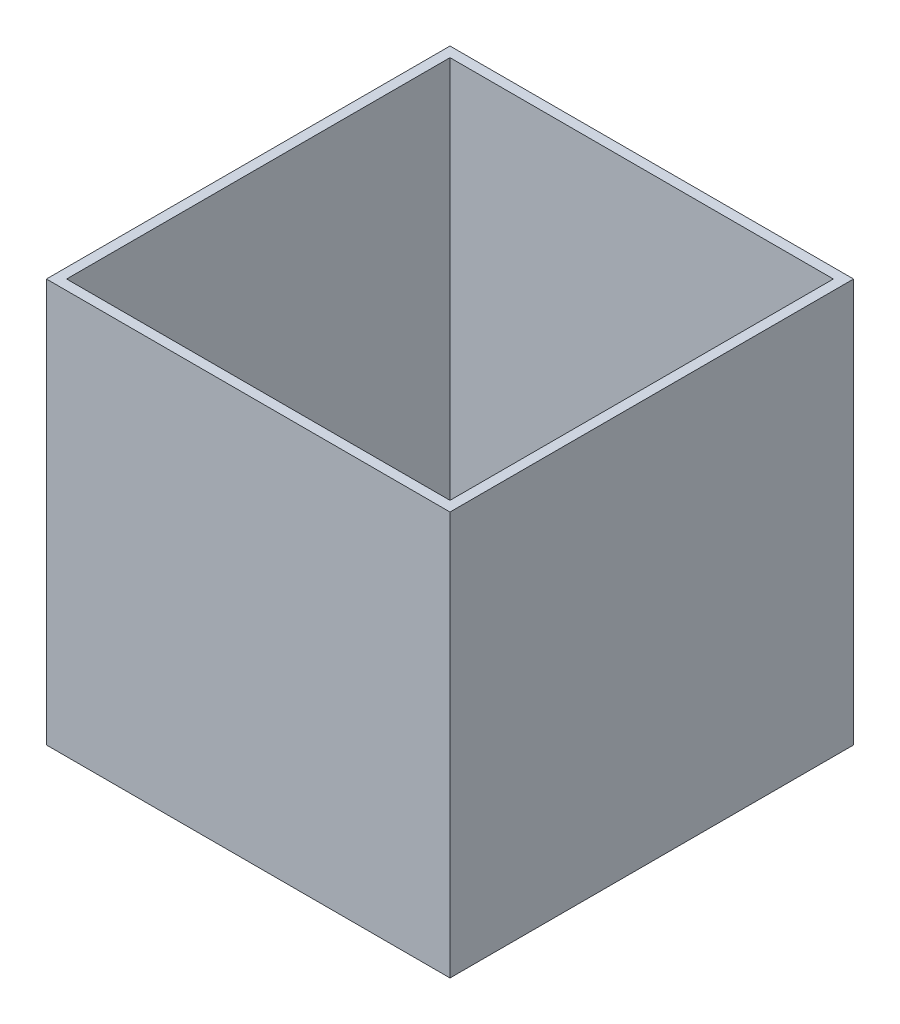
ISO-10303-21;
HEADER;
FILE_DESCRIPTION(('STEP AP214'),'2;1');
FILE_NAME('part.step','',(''),(''),'','','');
FILE_SCHEMA(('AUTOMOTIVE_DESIGN { 1 0 10303 214 1 1 1 1 }'));
ENDSEC;
DATA;
#1=APPLICATION_CONTEXT('core data for automotive mechanical design processes');
#2=APPLICATION_PROTOCOL_DEFINITION('international standard','automotive_design',2000,#1);
#3=PRODUCT_CONTEXT('',#1,'mechanical');
#4=PRODUCT('Part','Part','',(#3));
#5=PRODUCT_RELATED_PRODUCT_CATEGORY('part','',(#4));
#6=PRODUCT_DEFINITION_FORMATION('','',#4);
#7=PRODUCT_DEFINITION_CONTEXT('part definition',#1,'design');
#8=PRODUCT_DEFINITION('design','',#6,#7);
#9=PRODUCT_DEFINITION_SHAPE('','',#8);
#10=(LENGTH_UNIT() NAMED_UNIT(*) SI_UNIT(.MILLI.,.METRE.));
#11=(NAMED_UNIT(*) PLANE_ANGLE_UNIT() SI_UNIT($,.RADIAN.));
#12=(NAMED_UNIT(*) SI_UNIT($,.STERADIAN.) SOLID_ANGLE_UNIT());
#13=UNCERTAINTY_MEASURE_WITH_UNIT(LENGTH_MEASURE(1.E-05),#10,'distance_accuracy_value','');
#14=(GEOMETRIC_REPRESENTATION_CONTEXT(3) GLOBAL_UNCERTAINTY_ASSIGNED_CONTEXT((#13)) GLOBAL_UNIT_ASSIGNED_CONTEXT((#10,
#11,#12)) REPRESENTATION_CONTEXT('',''));
#15=CARTESIAN_POINT('',(0.,0.,0.));
#16=DIRECTION('',(0.,0.,1.));
#17=DIRECTION('',(1.,0.,0.));
#18=AXIS2_PLACEMENT_3D('',#15,#16,#17);
#19=CARTESIAN_POINT('',(0.,101.6,0.));
#20=DIRECTION('',(0.,0.,-1.));
#21=DIRECTION('',(-1.,0.,0.));
#22=AXIS2_PLACEMENT_3D('',#19,#20,#21);
#23=PLANE('',#22);
#24=DIRECTION('',(1.,0.,0.));
#25=VECTOR('',#24,1.);
#26=CARTESIAN_POINT('',(0.,0.,0.));
#27=LINE('',#26,#25);
#28=CARTESIAN_POINT('',(0.,0.,0.));
#29=VERTEX_POINT('',#28);
#30=CARTESIAN_POINT('',(101.6,0.,0.));
#31=VERTEX_POINT('',#30);
#32=EDGE_CURVE('E150',#29,#31,#27,.T.);
#33=ORIENTED_EDGE('',*,*,#32,.T.);
#34=DIRECTION('',(0.,-1.,0.));
#35=VECTOR('',#34,1.);
#36=CARTESIAN_POINT('',(101.6,101.6,0.));
#37=LINE('',#36,#35);
#38=CARTESIAN_POINT('',(101.6,101.6,0.));
#39=VERTEX_POINT('',#38);
#40=EDGE_CURVE('E11',#39,#31,#37,.T.);
#41=ORIENTED_EDGE('',*,*,#40,.F.);
#42=DIRECTION('',(1.,0.,0.));
#43=VECTOR('',#42,1.);
#44=CARTESIAN_POINT('',(0.,101.6,0.));
#45=LINE('',#44,#43);
#46=CARTESIAN_POINT('',(0.,101.6,0.));
#47=VERTEX_POINT('',#46);
#48=EDGE_CURVE('E141',#47,#39,#45,.T.);
#49=ORIENTED_EDGE('',*,*,#48,.F.);
#50=DIRECTION('',(0.,-1.,0.));
#51=VECTOR('',#50,1.);
#52=CARTESIAN_POINT('',(0.,101.6,0.));
#53=LINE('',#52,#51);
#54=EDGE_CURVE('E56',#47,#29,#53,.T.);
#55=ORIENTED_EDGE('',*,*,#54,.T.);
#56=EDGE_LOOP('',(#33,#41,#49,#55));
#57=FACE_BOUND('',#56,.T.);
#58=ADVANCED_FACE('F33',(#57),#23,.F.);
#59=CARTESIAN_POINT('',(101.6,101.6,0.));
#60=DIRECTION('',(-1.,0.,0.));
#61=DIRECTION('',(0.,0.,1.));
#62=AXIS2_PLACEMENT_3D('',#59,#60,#61);
#63=PLANE('',#62);
#64=DIRECTION('',(0.,0.,-1.));
#65=VECTOR('',#64,1.);
#66=CARTESIAN_POINT('',(101.6,0.,0.));
#67=LINE('',#66,#65);
#68=CARTESIAN_POINT('',(101.6,0.,-101.6));
#69=VERTEX_POINT('',#68);
#70=EDGE_CURVE('E152',#31,#69,#67,.T.);
#71=ORIENTED_EDGE('',*,*,#70,.T.);
#72=DIRECTION('',(0.,-1.,0.));
#73=VECTOR('',#72,1.);
#74=CARTESIAN_POINT('',(101.6,101.6,-101.6));
#75=LINE('',#74,#73);
#76=CARTESIAN_POINT('',(101.6,101.6,-101.6));
#77=VERTEX_POINT('',#76);
#78=EDGE_CURVE('E40',#77,#69,#75,.T.);
#79=ORIENTED_EDGE('',*,*,#78,.F.);
#80=DIRECTION('',(0.,0.,-1.));
#81=VECTOR('',#80,1.);
#82=CARTESIAN_POINT('',(101.6,101.6,0.));
#83=LINE('',#82,#81);
#84=EDGE_CURVE('E82',#39,#77,#83,.T.);
#85=ORIENTED_EDGE('',*,*,#84,.F.);
#86=ORIENTED_EDGE('',*,*,#40,.T.);
#87=EDGE_LOOP('',(#71,#79,#85,#86));
#88=FACE_BOUND('',#87,.T.);
#89=ADVANCED_FACE('F166',(#88),#63,.F.);
#90=CARTESIAN_POINT('',(0.,101.6,-101.6));
#91=DIRECTION('',(0.,0.,-1.));
#92=DIRECTION('',(-1.,0.,0.));
#93=AXIS2_PLACEMENT_3D('',#90,#91,#92);
#94=PLANE('',#93);
#95=DIRECTION('',(1.,0.,0.));
#96=VECTOR('',#95,1.);
#97=CARTESIAN_POINT('',(0.,0.,-101.6));
#98=LINE('',#97,#96);
#99=CARTESIAN_POINT('',(0.,0.,-101.6));
#100=VERTEX_POINT('',#99);
#101=EDGE_CURVE('E155',#100,#69,#98,.T.);
#102=ORIENTED_EDGE('',*,*,#101,.F.);
#103=DIRECTION('',(0.,-1.,0.));
#104=VECTOR('',#103,1.);
#105=CARTESIAN_POINT('',(0.,101.6,-101.6));
#106=LINE('',#105,#104);
#107=CARTESIAN_POINT('',(0.,101.6,-101.6));
#108=VERTEX_POINT('',#107);
#109=EDGE_CURVE('E161',#108,#100,#106,.T.);
#110=ORIENTED_EDGE('',*,*,#109,.F.);
#111=DIRECTION('',(1.,0.,0.));
#112=VECTOR('',#111,1.);
#113=CARTESIAN_POINT('',(0.,101.6,-101.6));
#114=LINE('',#113,#112);
#115=EDGE_CURVE('E145',#108,#77,#114,.T.);
#116=ORIENTED_EDGE('',*,*,#115,.T.);
#117=ORIENTED_EDGE('',*,*,#78,.T.);
#118=EDGE_LOOP('',(#102,#110,#116,#117));
#119=FACE_BOUND('',#118,.T.);
#120=ADVANCED_FACE('F164',(#119),#94,.T.);
#121=CARTESIAN_POINT('',(0.,101.6,0.));
#122=DIRECTION('',(-1.,0.,0.));
#123=DIRECTION('',(0.,0.,1.));
#124=AXIS2_PLACEMENT_3D('',#121,#122,#123);
#125=PLANE('',#124);
#126=DIRECTION('',(0.,0.,-1.));
#127=VECTOR('',#126,1.);
#128=CARTESIAN_POINT('',(0.,0.,0.));
#129=LINE('',#128,#127);
#130=EDGE_CURVE('E143',#29,#100,#129,.T.);
#131=ORIENTED_EDGE('',*,*,#130,.F.);
#132=ORIENTED_EDGE('',*,*,#54,.F.);
#133=DIRECTION('',(0.,0.,-1.));
#134=VECTOR('',#133,1.);
#135=CARTESIAN_POINT('',(0.,101.6,0.));
#136=LINE('',#135,#134);
#137=EDGE_CURVE('E148',#47,#108,#136,.T.);
#138=ORIENTED_EDGE('',*,*,#137,.T.);
#139=ORIENTED_EDGE('',*,*,#109,.T.);
#140=EDGE_LOOP('',(#131,#132,#138,#139));
#141=FACE_BOUND('',#140,.T.);
#142=ADVANCED_FACE('F170',(#141),#125,.T.);
#143=CARTESIAN_POINT('',(0.,101.6,0.));
#144=DIRECTION('',(0.,1.,0.));
#145=DIRECTION('',(0.,0.,1.));
#146=AXIS2_PLACEMENT_3D('',#143,#144,#145);
#147=PLANE('',#146);
#148=DIRECTION('',(1.,0.,0.));
#149=VECTOR('',#148,1.);
#150=CARTESIAN_POINT('',(0.,101.6,-2.54));
#151=LINE('',#150,#149);
#152=CARTESIAN_POINT('',(2.54,101.6,-2.54));
#153=VERTEX_POINT('',#152);
#154=CARTESIAN_POINT('',(99.06,101.6,-2.54));
#155=VERTEX_POINT('',#154);
#156=EDGE_CURVE('E131',#153,#155,#151,.T.);
#157=ORIENTED_EDGE('',*,*,#156,.F.);
#158=DIRECTION('',(0.,0.,-1.));
#159=VECTOR('',#158,1.);
#160=CARTESIAN_POINT('',(2.54,101.6,0.));
#161=LINE('',#160,#159);
#162=CARTESIAN_POINT('',(2.54,101.6,-99.06));
#163=VERTEX_POINT('',#162);
#164=EDGE_CURVE('E112',#153,#163,#161,.T.);
#165=ORIENTED_EDGE('',*,*,#164,.T.);
#166=DIRECTION('',(1.,0.,0.));
#167=VECTOR('',#166,1.);
#168=CARTESIAN_POINT('',(0.,101.6,-99.06));
#169=LINE('',#168,#167);
#170=CARTESIAN_POINT('',(99.06,101.6,-99.06));
#171=VERTEX_POINT('',#170);
#172=EDGE_CURVE('E47',#163,#171,#169,.T.);
#173=ORIENTED_EDGE('',*,*,#172,.T.);
#174=DIRECTION('',(0.,0.,-1.));
#175=VECTOR('',#174,1.);
#176=CARTESIAN_POINT('',(99.06,101.6,0.));
#177=LINE('',#176,#175);
#178=EDGE_CURVE('E133',#155,#171,#177,.T.);
#179=ORIENTED_EDGE('',*,*,#178,.F.);
#180=EDGE_LOOP('',(#157,#165,#173,#179));
#181=FACE_BOUND('',#180,.T.);
#182=ORIENTED_EDGE('',*,*,#48,.T.);
#183=ORIENTED_EDGE('',*,*,#84,.T.);
#184=ORIENTED_EDGE('',*,*,#115,.F.);
#185=ORIENTED_EDGE('',*,*,#137,.F.);
#186=EDGE_LOOP('',(#182,#183,#184,#185));
#187=FACE_BOUND('',#186,.T.);
#188=ADVANCED_FACE('F173',(#181,#187),#147,.T.);
#189=CARTESIAN_POINT('',(0.,0.,0.));
#190=DIRECTION('',(0.,1.,0.));
#191=DIRECTION('',(0.,0.,1.));
#192=AXIS2_PLACEMENT_3D('',#189,#190,#191);
#193=PLANE('',#192);
#194=ORIENTED_EDGE('',*,*,#32,.F.);
#195=ORIENTED_EDGE('',*,*,#130,.T.);
#196=ORIENTED_EDGE('',*,*,#101,.T.);
#197=ORIENTED_EDGE('',*,*,#70,.F.);
#198=EDGE_LOOP('',(#194,#195,#196,#197));
#199=FACE_BOUND('',#198,.T.);
#200=ADVANCED_FACE('F169',(#199),#193,.F.);
#201=CARTESIAN_POINT('',(0.,101.6,-2.54));
#202=DIRECTION('',(0.,0.,-1.));
#203=DIRECTION('',(-1.,0.,0.));
#204=AXIS2_PLACEMENT_3D('',#201,#202,#203);
#205=PLANE('',#204);
#206=DIRECTION('',(1.,0.,0.));
#207=VECTOR('',#206,1.);
#208=CARTESIAN_POINT('',(0.,2.54,-2.54));
#209=LINE('',#208,#207);
#210=CARTESIAN_POINT('',(2.54,2.54,-2.54));
#211=VERTEX_POINT('',#210);
#212=CARTESIAN_POINT('',(99.06,2.54,-2.54));
#213=VERTEX_POINT('',#212);
#214=EDGE_CURVE('E119',#211,#213,#209,.T.);
#215=ORIENTED_EDGE('',*,*,#214,.F.);
#216=DIRECTION('',(0.,-1.,0.));
#217=VECTOR('',#216,1.);
#218=CARTESIAN_POINT('',(2.54,101.6,-2.54));
#219=LINE('',#218,#217);
#220=EDGE_CURVE('E106',#153,#211,#219,.T.);
#221=ORIENTED_EDGE('',*,*,#220,.F.);
#222=ORIENTED_EDGE('',*,*,#156,.T.);
#223=DIRECTION('',(0.,-1.,0.));
#224=VECTOR('',#223,1.);
#225=CARTESIAN_POINT('',(99.06,101.6,-2.54));
#226=LINE('',#225,#224);
#227=EDGE_CURVE('E122',#155,#213,#226,.T.);
#228=ORIENTED_EDGE('',*,*,#227,.T.);
#229=EDGE_LOOP('',(#215,#221,#222,#228));
#230=FACE_BOUND('',#229,.T.);
#231=ADVANCED_FACE('F120',(#230),#205,.T.);
#232=CARTESIAN_POINT('',(99.06,101.6,0.));
#233=DIRECTION('',(-1.,0.,0.));
#234=DIRECTION('',(0.,0.,1.));
#235=AXIS2_PLACEMENT_3D('',#232,#233,#234);
#236=PLANE('',#235);
#237=DIRECTION('',(0.,0.,-1.));
#238=VECTOR('',#237,1.);
#239=CARTESIAN_POINT('',(99.06,2.54,0.));
#240=LINE('',#239,#238);
#241=CARTESIAN_POINT('',(99.06,2.54,-99.06));
#242=VERTEX_POINT('',#241);
#243=EDGE_CURVE('E125',#213,#242,#240,.T.);
#244=ORIENTED_EDGE('',*,*,#243,.F.);
#245=ORIENTED_EDGE('',*,*,#227,.F.);
#246=ORIENTED_EDGE('',*,*,#178,.T.);
#247=DIRECTION('',(0.,-1.,0.));
#248=VECTOR('',#247,1.);
#249=CARTESIAN_POINT('',(99.06,101.6,-99.06));
#250=LINE('',#249,#248);
#251=EDGE_CURVE('E265',#171,#242,#250,.T.);
#252=ORIENTED_EDGE('',*,*,#251,.T.);
#253=EDGE_LOOP('',(#244,#245,#246,#252));
#254=FACE_BOUND('',#253,.T.);
#255=ADVANCED_FACE('F197',(#254),#236,.T.);
#256=CARTESIAN_POINT('',(0.,101.6,-99.06));
#257=DIRECTION('',(0.,0.,-1.));
#258=DIRECTION('',(-1.,0.,0.));
#259=AXIS2_PLACEMENT_3D('',#256,#257,#258);
#260=PLANE('',#259);
#261=DIRECTION('',(1.,0.,0.));
#262=VECTOR('',#261,1.);
#263=CARTESIAN_POINT('',(0.,2.54,-99.06));
#264=LINE('',#263,#262);
#265=CARTESIAN_POINT('',(2.54,2.54,-99.06));
#266=VERTEX_POINT('',#265);
#267=EDGE_CURVE('E130',#266,#242,#264,.T.);
#268=ORIENTED_EDGE('',*,*,#267,.T.);
#269=ORIENTED_EDGE('',*,*,#251,.F.);
#270=ORIENTED_EDGE('',*,*,#172,.F.);
#271=DIRECTION('',(0.,-1.,0.));
#272=VECTOR('',#271,1.);
#273=CARTESIAN_POINT('',(2.54,101.6,-99.06));
#274=LINE('',#273,#272);
#275=EDGE_CURVE('E115',#163,#266,#274,.T.);
#276=ORIENTED_EDGE('',*,*,#275,.T.);
#277=EDGE_LOOP('',(#268,#269,#270,#276));
#278=FACE_BOUND('',#277,.T.);
#279=ADVANCED_FACE('F194',(#278),#260,.F.);
#280=CARTESIAN_POINT('',(2.54,101.6,0.));
#281=DIRECTION('',(-1.,0.,0.));
#282=DIRECTION('',(0.,0.,1.));
#283=AXIS2_PLACEMENT_3D('',#280,#281,#282);
#284=PLANE('',#283);
#285=DIRECTION('',(0.,0.,-1.));
#286=VECTOR('',#285,1.);
#287=CARTESIAN_POINT('',(2.54,2.54,0.));
#288=LINE('',#287,#286);
#289=EDGE_CURVE('E110',#211,#266,#288,.T.);
#290=ORIENTED_EDGE('',*,*,#289,.T.);
#291=ORIENTED_EDGE('',*,*,#275,.F.);
#292=ORIENTED_EDGE('',*,*,#164,.F.);
#293=ORIENTED_EDGE('',*,*,#220,.T.);
#294=EDGE_LOOP('',(#290,#291,#292,#293));
#295=FACE_BOUND('',#294,.T.);
#296=ADVANCED_FACE('F108',(#295),#284,.F.);
#297=CARTESIAN_POINT('',(0.,2.54,0.));
#298=DIRECTION('',(0.,1.,0.));
#299=DIRECTION('',(0.,0.,1.));
#300=AXIS2_PLACEMENT_3D('',#297,#298,#299);
#301=PLANE('',#300);
#302=ORIENTED_EDGE('',*,*,#214,.T.);
#303=ORIENTED_EDGE('',*,*,#243,.T.);
#304=ORIENTED_EDGE('',*,*,#267,.F.);
#305=ORIENTED_EDGE('',*,*,#289,.F.);
#306=EDGE_LOOP('',(#302,#303,#304,#305));
#307=FACE_BOUND('',#306,.T.);
#308=ADVANCED_FACE('F128',(#307),#301,.T.);
#309=CLOSED_SHELL('',(#58,#89,#120,#142,#188,#200,#231,#255,#279,#296,#308));
#310=MANIFOLD_SOLID_BREP('B2',#309);
#311=ADVANCED_BREP_SHAPE_REPRESENTATION('',(#18,#310),#14);
#312=SHAPE_DEFINITION_REPRESENTATION(#9,#311);
ENDSEC;
END-ISO-10303-21;
